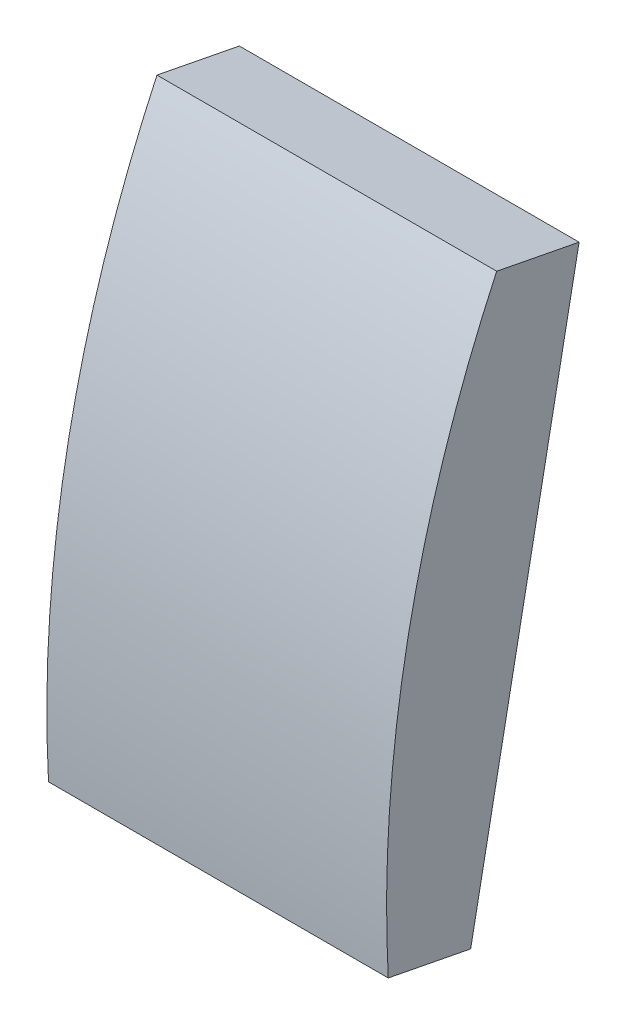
ISO-10303-21;
HEADER;
FILE_DESCRIPTION(('STEP AP214'),'2;1');
FILE_NAME('part.step','',(''),(''),'','','');
FILE_SCHEMA(('AUTOMOTIVE_DESIGN { 1 0 10303 214 1 1 1 1 }'));
ENDSEC;
DATA;
#1=APPLICATION_CONTEXT('core data for automotive mechanical design processes');
#2=APPLICATION_PROTOCOL_DEFINITION('international standard','automotive_design',2000,#1);
#3=PRODUCT_CONTEXT('',#1,'mechanical');
#4=PRODUCT('Part','Part','',(#3));
#5=PRODUCT_RELATED_PRODUCT_CATEGORY('part','',(#4));
#6=PRODUCT_DEFINITION_FORMATION('','',#4);
#7=PRODUCT_DEFINITION_CONTEXT('part definition',#1,'design');
#8=PRODUCT_DEFINITION('design','',#6,#7);
#9=PRODUCT_DEFINITION_SHAPE('','',#8);
#10=(LENGTH_UNIT() NAMED_UNIT(*) SI_UNIT(.MILLI.,.METRE.));
#11=(NAMED_UNIT(*) PLANE_ANGLE_UNIT() SI_UNIT($,.RADIAN.));
#12=(NAMED_UNIT(*) SI_UNIT($,.STERADIAN.) SOLID_ANGLE_UNIT());
#13=UNCERTAINTY_MEASURE_WITH_UNIT(LENGTH_MEASURE(1.E-05),#10,'distance_accuracy_value','');
#14=(GEOMETRIC_REPRESENTATION_CONTEXT(3) GLOBAL_UNCERTAINTY_ASSIGNED_CONTEXT((#13)) GLOBAL_UNIT_ASSIGNED_CONTEXT((#10,
#11,#12)) REPRESENTATION_CONTEXT('',''));
#15=CARTESIAN_POINT('',(0.,0.,0.));
#16=DIRECTION('',(0.,0.,1.));
#17=DIRECTION('',(1.,0.,0.));
#18=AXIS2_PLACEMENT_3D('',#15,#16,#17);
#19=CARTESIAN_POINT('',(-878.375460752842,-442.558089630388,-441.708153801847));
#20=DIRECTION('',(0.,-0.190808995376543,-0.981627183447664));
#21=DIRECTION('',(0.,0.981627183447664,-0.190808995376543));
#22=AXIS2_PLACEMENT_3D('',#19,#20,#21);
#23=PLANE('',#22);
#24=DIRECTION('',(0.,0.981627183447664,-0.190808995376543));
#25=VECTOR('',#24,1.);
#26=CARTESIAN_POINT('',(-878.375460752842,-487.812084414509,-432.911668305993));
#27=LINE('',#26,#25);
#28=CARTESIAN_POINT('',(-878.375460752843,-487.812084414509,-432.911668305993));
#29=VERTEX_POINT('',#28);
#30=CARTESIAN_POINT('',(-878.375460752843,-442.558089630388,-441.708153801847));
#31=VERTEX_POINT('',#30);
#32=EDGE_CURVE('E82',#29,#31,#27,.T.);
#33=ORIENTED_EDGE('',*,*,#32,.T.);
#34=DIRECTION('',(1.,0.,0.));
#35=VECTOR('',#34,1.);
#36=CARTESIAN_POINT('',(-878.375460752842,-442.558089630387,-441.708153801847));
#37=LINE('',#36,#35);
#38=CARTESIAN_POINT('',(-850.816460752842,-442.558089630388,-441.708153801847));
#39=VERTEX_POINT('',#38);
#40=EDGE_CURVE('E72',#39,#31,#37,.F.);
#41=ORIENTED_EDGE('',*,*,#40,.F.);
#42=DIRECTION('',(0.,0.981627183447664,-0.190808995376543));
#43=VECTOR('',#42,1.);
#44=CARTESIAN_POINT('',(-850.816460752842,-487.812084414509,-432.911668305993));
#45=LINE('',#44,#43);
#46=CARTESIAN_POINT('',(-850.816460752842,-487.812084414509,-432.911668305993));
#47=VERTEX_POINT('',#46);
#48=EDGE_CURVE('E106',#47,#39,#45,.T.);
#49=ORIENTED_EDGE('',*,*,#48,.F.);
#50=DIRECTION('',(1.,0.,0.));
#51=VECTOR('',#50,1.);
#52=CARTESIAN_POINT('',(-878.375460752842,-487.812084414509,-432.911668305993));
#53=LINE('',#52,#51);
#54=EDGE_CURVE('E78',#29,#47,#53,.T.);
#55=ORIENTED_EDGE('',*,*,#54,.F.);
#56=EDGE_LOOP('',(#33,#41,#49,#55));
#57=FACE_BOUND('',#56,.T.);
#58=ADVANCED_FACE('F36',(#57),#23,.T.);
#59=CARTESIAN_POINT('',(-878.375460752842,-441.258479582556,-435.022239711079));
#60=DIRECTION('',(0.,0.981627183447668,-0.190808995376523));
#61=DIRECTION('',(0.,0.190808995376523,0.981627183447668));
#62=AXIS2_PLACEMENT_3D('',#59,#60,#61);
#63=PLANE('',#62);
#64=DIRECTION('',(0.,0.190808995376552,0.981627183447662));
#65=VECTOR('',#64,1.);
#66=CARTESIAN_POINT('',(-878.375460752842,-442.558089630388,-441.708153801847));
#67=LINE('',#66,#65);
#68=CARTESIAN_POINT('',(-878.375460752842,-441.258479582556,-435.02223971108));
#69=VERTEX_POINT('',#68);
#70=EDGE_CURVE('E89',#31,#69,#67,.T.);
#71=ORIENTED_EDGE('',*,*,#70,.T.);
#72=DIRECTION('',(1.,0.,0.));
#73=VECTOR('',#72,1.);
#74=CARTESIAN_POINT('',(-878.375460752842,-441.258479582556,-435.02223971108));
#75=LINE('',#74,#73);
#76=CARTESIAN_POINT('',(-850.816460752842,-441.258479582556,-435.02223971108));
#77=VERTEX_POINT('',#76);
#78=EDGE_CURVE('E94',#77,#69,#75,.F.);
#79=ORIENTED_EDGE('',*,*,#78,.F.);
#80=DIRECTION('',(0.,0.190808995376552,0.981627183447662));
#81=VECTOR('',#80,1.);
#82=CARTESIAN_POINT('',(-850.816460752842,-442.558089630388,-441.708153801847));
#83=LINE('',#82,#81);
#84=EDGE_CURVE('E91',#39,#77,#83,.T.);
#85=ORIENTED_EDGE('',*,*,#84,.F.);
#86=ORIENTED_EDGE('',*,*,#40,.T.);
#87=EDGE_LOOP('',(#71,#79,#85,#86));
#88=FACE_BOUND('',#87,.T.);
#89=ADVANCED_FACE('F93',(#88),#63,.T.);
#90=CARTESIAN_POINT('',(-878.375460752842,-464.29690531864,-432.740612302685));
#91=DIRECTION('',(1.,0.,0.));
#92=DIRECTION('',(0.,1.,0.));
#93=AXIS2_PLACEMENT_3D('',#90,#91,#92);
#94=PLANE('',#93);
#95=CARTESIAN_POINT('',(-878.375460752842,-481.457373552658,-521.023568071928));
#96=DIRECTION('',(1.,0.,0.));
#97=DIRECTION('',(0.,0.,-1.));
#98=AXIS2_PLACEMENT_3D('',#95,#96,#97);
#99=CIRCLE('',#98,94.9325);
#100=CARTESIAN_POINT('',(-878.375460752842,-486.512474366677,-426.225754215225));
#101=VERTEX_POINT('',#100);
#102=EDGE_CURVE('E40',#69,#101,#99,.T.);
#103=ORIENTED_EDGE('',*,*,#102,.F.);
#104=ORIENTED_EDGE('',*,*,#70,.F.);
#105=ORIENTED_EDGE('',*,*,#32,.F.);
#106=DIRECTION('',(0.,-0.190808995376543,-0.981627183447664));
#107=VECTOR('',#106,1.);
#108=CARTESIAN_POINT('',(-878.375460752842,-487.812084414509,-432.911668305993));
#109=LINE('',#108,#107);
#110=EDGE_CURVE('E90',#101,#29,#109,.T.);
#111=ORIENTED_EDGE('',*,*,#110,.F.);
#112=EDGE_LOOP('',(#103,#104,#105,#111));
#113=FACE_BOUND('',#112,.T.);
#114=ADVANCED_FACE('F88',(#113),#94,.F.);
#115=CARTESIAN_POINT('',(-878.375460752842,-487.812084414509,-432.911668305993));
#116=DIRECTION('',(0.,-0.981627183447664,0.190808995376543));
#117=DIRECTION('',(0.,-0.190808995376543,-0.981627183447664));
#118=AXIS2_PLACEMENT_3D('',#115,#116,#117);
#119=PLANE('',#118);
#120=ORIENTED_EDGE('',*,*,#110,.T.);
#121=ORIENTED_EDGE('',*,*,#54,.T.);
#122=DIRECTION('',(0.,-0.190808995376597,-0.981627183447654));
#123=VECTOR('',#122,1.);
#124=CARTESIAN_POINT('',(-850.816460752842,-486.512474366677,-426.225754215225));
#125=LINE('',#124,#123);
#126=CARTESIAN_POINT('',(-850.816460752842,-486.512474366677,-426.225754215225));
#127=VERTEX_POINT('',#126);
#128=EDGE_CURVE('E54',#127,#47,#125,.T.);
#129=ORIENTED_EDGE('',*,*,#128,.F.);
#130=DIRECTION('',(1.,0.,0.));
#131=VECTOR('',#130,1.);
#132=CARTESIAN_POINT('',(-878.375460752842,-486.512474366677,-426.225754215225));
#133=LINE('',#132,#131);
#134=EDGE_CURVE('E46',#101,#127,#133,.T.);
#135=ORIENTED_EDGE('',*,*,#134,.F.);
#136=EDGE_LOOP('',(#120,#121,#129,#135));
#137=FACE_BOUND('',#136,.T.);
#138=ADVANCED_FACE('F136',(#137),#119,.T.);
#139=CARTESIAN_POINT('',(-850.816460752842,-486.512474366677,-426.225754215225));
#140=DIRECTION('',(1.,0.,0.));
#141=DIRECTION('',(0.,1.,0.));
#142=AXIS2_PLACEMENT_3D('',#139,#140,#141);
#143=PLANE('',#142);
#144=ORIENTED_EDGE('',*,*,#84,.T.);
#145=CARTESIAN_POINT('',(-850.816460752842,-481.457373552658,-521.023568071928));
#146=DIRECTION('',(1.,0.,0.));
#147=DIRECTION('',(0.,0.,-1.));
#148=AXIS2_PLACEMENT_3D('',#145,#146,#147);
#149=CIRCLE('',#148,94.9325);
#150=EDGE_CURVE('E11',#127,#77,#149,.F.);
#151=ORIENTED_EDGE('',*,*,#150,.F.);
#152=ORIENTED_EDGE('',*,*,#128,.T.);
#153=ORIENTED_EDGE('',*,*,#48,.T.);
#154=EDGE_LOOP('',(#144,#151,#152,#153));
#155=FACE_BOUND('',#154,.T.);
#156=ADVANCED_FACE('F125',(#155),#143,.T.);
#157=CARTESIAN_POINT('',(-878.375460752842,-481.457373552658,-521.023568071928));
#158=DIRECTION('',(1.,0.,0.));
#159=DIRECTION('',(0.,0.,-1.));
#160=AXIS2_PLACEMENT_3D('',#157,#158,#159);
#161=CYLINDRICAL_SURFACE('',#160,94.9325);
#162=ORIENTED_EDGE('',*,*,#134,.T.);
#163=ORIENTED_EDGE('',*,*,#150,.T.);
#164=ORIENTED_EDGE('',*,*,#78,.T.);
#165=ORIENTED_EDGE('',*,*,#102,.T.);
#166=EDGE_LOOP('',(#162,#163,#164,#165));
#167=FACE_BOUND('',#166,.T.);
#168=ADVANCED_FACE('F38',(#167),#161,.T.);
#169=CLOSED_SHELL('',(#58,#89,#114,#138,#156,#168));
#170=MANIFOLD_SOLID_BREP('B2',#169);
#171=ADVANCED_BREP_SHAPE_REPRESENTATION('',(#18,#170),#14);
#172=SHAPE_DEFINITION_REPRESENTATION(#9,#171);
ENDSEC;
END-ISO-10303-21;
